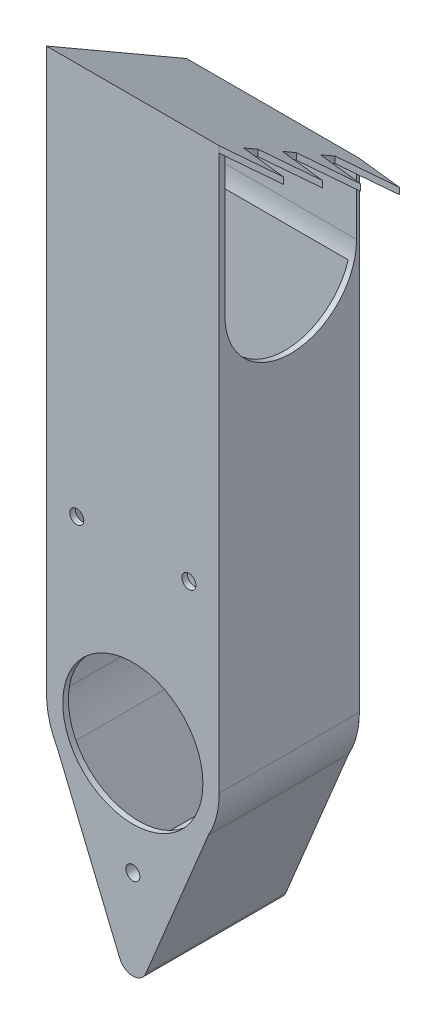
ISO-10303-21;
HEADER;
FILE_DESCRIPTION(('STEP AP214'),'2;1');
FILE_NAME('part.step','',(''),(''),'','','');
FILE_SCHEMA(('AUTOMOTIVE_DESIGN { 1 0 10303 214 1 1 1 1 }'));
ENDSEC;
DATA;
#1=APPLICATION_CONTEXT('core data for automotive mechanical design processes');
#2=APPLICATION_PROTOCOL_DEFINITION('international standard','automotive_design',2000,#1);
#3=PRODUCT_CONTEXT('',#1,'mechanical');
#4=PRODUCT('Part','Part','',(#3));
#5=PRODUCT_RELATED_PRODUCT_CATEGORY('part','',(#4));
#6=PRODUCT_DEFINITION_FORMATION('','',#4);
#7=PRODUCT_DEFINITION_CONTEXT('part definition',#1,'design');
#8=PRODUCT_DEFINITION('design','',#6,#7);
#9=PRODUCT_DEFINITION_SHAPE('','',#8);
#10=(LENGTH_UNIT() NAMED_UNIT(*) SI_UNIT(.MILLI.,.METRE.));
#11=(NAMED_UNIT(*) PLANE_ANGLE_UNIT() SI_UNIT($,.RADIAN.));
#12=(NAMED_UNIT(*) SI_UNIT($,.STERADIAN.) SOLID_ANGLE_UNIT());
#13=UNCERTAINTY_MEASURE_WITH_UNIT(LENGTH_MEASURE(1.E-05),#10,'distance_accuracy_value','');
#14=(GEOMETRIC_REPRESENTATION_CONTEXT(3) GLOBAL_UNCERTAINTY_ASSIGNED_CONTEXT((#13)) GLOBAL_UNIT_ASSIGNED_CONTEXT((#10,
#11,#12)) REPRESENTATION_CONTEXT('',''));
#15=CARTESIAN_POINT('',(0.,0.,0.));
#16=DIRECTION('',(0.,0.,1.));
#17=DIRECTION('',(1.,0.,0.));
#18=AXIS2_PLACEMENT_3D('',#15,#16,#17);
#19=CARTESIAN_POINT('',(41.1040145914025,334.660691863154,63.5));
#20=DIRECTION('',(-1.,0.,0.));
#21=DIRECTION('',(0.,0.,1.));
#22=AXIS2_PLACEMENT_3D('',#19,#20,#21);
#23=PLANE('',#22);
#24=DIRECTION('',(0.,-0.499999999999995,-0.866025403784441));
#25=VECTOR('',#24,1.);
#26=CARTESIAN_POINT('',(41.1040145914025,324.486077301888,50.9570506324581));
#27=LINE('',#26,#25);
#28=CARTESIAN_POINT('',(41.1040145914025,331.72775249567,63.5));
#29=VERTEX_POINT('',#28);
#30=CARTESIAN_POINT('',(41.1040145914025,330.261282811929,60.96));
#31=VERTEX_POINT('',#30);
#32=EDGE_CURVE('E368',#29,#31,#27,.T.);
#33=ORIENTED_EDGE('',*,*,#32,.F.);
#34=DIRECTION('',(0.,1.,0.));
#35=VECTOR('',#34,1.);
#36=CARTESIAN_POINT('',(41.1040145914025,334.660691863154,63.5));
#37=LINE('',#36,#35);
#38=CARTESIAN_POINT('',(41.1040145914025,80.6606918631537,63.5));
#39=VERTEX_POINT('',#38);
#40=EDGE_CURVE('E273',#39,#29,#37,.T.);
#41=ORIENTED_EDGE('',*,*,#40,.F.);
#42=DIRECTION('',(0.,0.,-1.));
#43=VECTOR('',#42,1.);
#44=CARTESIAN_POINT('',(41.1040145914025,80.6606918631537,63.5));
#45=LINE('',#44,#43);
#46=CARTESIAN_POINT('',(41.1040145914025,80.6606918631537,0.));
#47=VERTEX_POINT('',#46);
#48=EDGE_CURVE('E322',#39,#47,#45,.T.);
#49=ORIENTED_EDGE('',*,*,#48,.T.);
#50=DIRECTION('',(0.,1.,0.));
#51=VECTOR('',#50,1.);
#52=CARTESIAN_POINT('',(41.1040145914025,334.660691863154,0.));
#53=LINE('',#52,#51);
#54=CARTESIAN_POINT('',(41.1040145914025,295.06601040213,0.));
#55=VERTEX_POINT('',#54);
#56=EDGE_CURVE('E304',#47,#55,#53,.T.);
#57=ORIENTED_EDGE('',*,*,#56,.T.);
#58=DIRECTION('',(0.,-0.499999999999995,-0.866025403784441));
#59=VECTOR('',#58,1.);
#60=CARTESIAN_POINT('',(41.1040145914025,294.174335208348,-1.54442673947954));
#61=LINE('',#60,#59);
#62=CARTESIAN_POINT('',(41.1040145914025,295.799245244,1.26999999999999));
#63=VERTEX_POINT('',#62);
#64=EDGE_CURVE('E438',#63,#55,#61,.T.);
#65=ORIENTED_EDGE('',*,*,#64,.F.);
#66=DIRECTION('',(0.,1.,0.));
#67=VECTOR('',#66,1.);
#68=CARTESIAN_POINT('',(41.1040145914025,295.799245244,1.26999999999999));
#69=LINE('',#68,#67);
#70=CARTESIAN_POINT('',(41.1040145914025,266.761282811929,1.26999999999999));
#71=VERTEX_POINT('',#70);
#72=EDGE_CURVE('E596',#71,#63,#69,.T.);
#73=ORIENTED_EDGE('',*,*,#72,.F.);
#74=CARTESIAN_POINT('',(41.1040145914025,266.761282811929,31.115));
#75=DIRECTION('',(1.,0.,0.));
#76=DIRECTION('',(0.,0.,-1.));
#77=AXIS2_PLACEMENT_3D('',#74,#75,#76);
#78=CIRCLE('',#77,29.845);
#79=CARTESIAN_POINT('',(41.1040145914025,266.761282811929,60.96));
#80=VERTEX_POINT('',#79);
#81=EDGE_CURVE('E575',#80,#71,#78,.T.);
#82=ORIENTED_EDGE('',*,*,#81,.F.);
#83=DIRECTION('',(0.,-1.,0.));
#84=VECTOR('',#83,1.);
#85=CARTESIAN_POINT('',(41.1040145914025,266.761282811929,60.96));
#86=LINE('',#85,#84);
#87=EDGE_CURVE('E371',#31,#80,#86,.T.);
#88=ORIENTED_EDGE('',*,*,#87,.F.);
#89=EDGE_LOOP('',(#33,#41,#49,#57,#65,#73,#82,#88));
#90=FACE_BOUND('',#89,.T.);
#91=ADVANCED_FACE('F39',(#90),#23,.F.);
#92=DIRECTION('',(0.,-0.499999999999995,-0.866025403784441));
#93=VECTOR('',#92,1.);
#94=CARTESIAN_POINT('',(41.1040145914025,297.998949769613,0.));
#95=LINE('',#94,#93);
#96=CARTESIAN_POINT('',(41.1040145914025,318.150691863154,34.9038411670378));
#97=VERTEX_POINT('',#96);
#98=CARTESIAN_POINT('',(41.1040145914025,314.508949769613,28.5961588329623));
#99=VERTEX_POINT('',#98);
#100=EDGE_CURVE('E625',#97,#99,#95,.T.);
#101=ORIENTED_EDGE('',*,*,#100,.F.);
#102=DIRECTION('',(0.,1.,0.));
#103=VECTOR('',#102,1.);
#104=CARTESIAN_POINT('',(41.1040145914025,286.251051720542,34.9038411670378));
#105=LINE('',#104,#103);
#106=CARTESIAN_POINT('',(41.1040145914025,315.217752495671,34.9038411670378));
#107=VERTEX_POINT('',#106);
#108=EDGE_CURVE('E395',#107,#97,#105,.T.);
#109=ORIENTED_EDGE('',*,*,#108,.F.);
#110=DIRECTION('',(0.,0.499999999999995,0.866025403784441));
#111=VECTOR('',#110,1.);
#112=CARTESIAN_POINT('',(41.1040145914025,330.261282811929,60.96));
#113=LINE('',#112,#111);
#114=CARTESIAN_POINT('',(41.1040145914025,311.576010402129,28.5961588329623));
#115=VERTEX_POINT('',#114);
#116=EDGE_CURVE('E605',#115,#107,#113,.T.);
#117=ORIENTED_EDGE('',*,*,#116,.F.);
#118=DIRECTION('',(0.,1.,0.));
#119=VECTOR('',#118,1.);
#120=CARTESIAN_POINT('',(41.1040145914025,282.609309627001,28.5961588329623));
#121=LINE('',#120,#119);
#122=EDGE_CURVE('E63',#115,#99,#121,.T.);
#123=ORIENTED_EDGE('',*,*,#122,.T.);
#124=EDGE_LOOP('',(#101,#109,#117,#123));
#125=FACE_BOUND('',#124,.T.);
#126=ADVANCED_FACE('F752',(#125),#23,.F.);
#127=CARTESIAN_POINT('',(41.1040145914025,308.158949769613,17.5976362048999));
#128=VERTEX_POINT('',#127);
#129=CARTESIAN_POINT('',(41.1040145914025,304.348949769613,10.9985226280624));
#130=VERTEX_POINT('',#129);
#131=EDGE_CURVE('E626',#128,#130,#95,.T.);
#132=ORIENTED_EDGE('',*,*,#131,.F.);
#133=DIRECTION('',(0.,1.,0.));
#134=VECTOR('',#133,1.);
#135=CARTESIAN_POINT('',(41.1040145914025,276.259309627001,17.5976362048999));
#136=LINE('',#135,#134);
#137=CARTESIAN_POINT('',(41.1040145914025,305.22601040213,17.5976362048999));
#138=VERTEX_POINT('',#137);
#139=EDGE_CURVE('E417',#138,#128,#136,.T.);
#140=ORIENTED_EDGE('',*,*,#139,.F.);
#141=CARTESIAN_POINT('',(41.1040145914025,301.41601040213,10.9985226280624));
#142=VERTEX_POINT('',#141);
#143=EDGE_CURVE('E601',#142,#138,#113,.T.);
#144=ORIENTED_EDGE('',*,*,#143,.F.);
#145=DIRECTION('',(0.,1.,0.));
#146=VECTOR('',#145,1.);
#147=CARTESIAN_POINT('',(41.1040145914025,272.449309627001,10.9985226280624));
#148=LINE('',#147,#146);
#149=EDGE_CURVE('E450',#142,#130,#148,.T.);
#150=ORIENTED_EDGE('',*,*,#149,.T.);
#151=EDGE_LOOP('',(#132,#140,#144,#150));
#152=FACE_BOUND('',#151,.T.);
#153=ADVANCED_FACE('F758',(#152),#23,.F.);
#154=CARTESIAN_POINT('',(27.3621407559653,156.860691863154,63.5));
#155=DIRECTION('',(0.,0.,-1.));
#156=DIRECTION('',(-1.,0.,0.));
#157=AXIS2_PLACEMENT_3D('',#154,#155,#156);
#158=CYLINDRICAL_SURFACE('',#157,3.175);
#159=CARTESIAN_POINT('',(27.3621407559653,156.860691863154,0.));
#160=DIRECTION('',(0.,0.,1.));
#161=DIRECTION('',(1.,0.,0.));
#162=AXIS2_PLACEMENT_3D('',#159,#160,#161);
#163=CIRCLE('',#162,3.175);
#164=CARTESIAN_POINT('',(30.5371407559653,156.860691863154,0.));
#165=VERTEX_POINT('',#164);
#166=EDGE_CURVE('E644',#165,#165,#163,.T.);
#167=ORIENTED_EDGE('',*,*,#166,.F.);
#168=EDGE_LOOP('',(#167));
#169=FACE_BOUND('',#168,.T.);
#170=CARTESIAN_POINT('',(27.3621407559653,156.860691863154,2.54));
#171=DIRECTION('',(0.,0.,1.));
#172=DIRECTION('',(1.,0.,0.));
#173=AXIS2_PLACEMENT_3D('',#170,#171,#172);
#174=CIRCLE('',#173,3.175);
#175=CARTESIAN_POINT('',(30.5371407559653,156.860691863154,2.54));
#176=VERTEX_POINT('',#175);
#177=EDGE_CURVE('E551',#176,#176,#174,.T.);
#178=ORIENTED_EDGE('',*,*,#177,.T.);
#179=EDGE_LOOP('',(#178));
#180=FACE_BOUND('',#179,.T.);
#181=ADVANCED_FACE('F770',(#169,#180),#158,.F.);
#182=CARTESIAN_POINT('',(-23.4378592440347,156.860691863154,63.5));
#183=DIRECTION('',(0.,0.,-1.));
#184=DIRECTION('',(-1.,0.,0.));
#185=AXIS2_PLACEMENT_3D('',#182,#183,#184);
#186=CYLINDRICAL_SURFACE('',#185,3.175);
#187=CARTESIAN_POINT('',(-23.4378592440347,156.860691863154,0.));
#188=DIRECTION('',(0.,0.,1.));
#189=DIRECTION('',(1.,0.,0.));
#190=AXIS2_PLACEMENT_3D('',#187,#188,#189);
#191=CIRCLE('',#190,3.175);
#192=CARTESIAN_POINT('',(-20.2628592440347,156.860691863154,0.));
#193=VERTEX_POINT('',#192);
#194=EDGE_CURVE('E636',#193,#193,#191,.T.);
#195=ORIENTED_EDGE('',*,*,#194,.F.);
#196=EDGE_LOOP('',(#195));
#197=FACE_BOUND('',#196,.T.);
#198=CARTESIAN_POINT('',(-23.4378592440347,156.860691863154,2.54));
#199=DIRECTION('',(0.,0.,1.));
#200=DIRECTION('',(1.,0.,0.));
#201=AXIS2_PLACEMENT_3D('',#198,#199,#200);
#202=CIRCLE('',#201,3.175);
#203=CARTESIAN_POINT('',(-20.2628592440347,156.860691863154,2.54));
#204=VERTEX_POINT('',#203);
#205=EDGE_CURVE('E499',#204,#204,#202,.T.);
#206=ORIENTED_EDGE('',*,*,#205,.T.);
#207=EDGE_LOOP('',(#206));
#208=FACE_BOUND('',#207,.T.);
#209=ADVANCED_FACE('F775',(#197,#208),#186,.F.);
#210=CARTESIAN_POINT('',(-32.5559854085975,266.761282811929,31.115));
#211=DIRECTION('',(1.,0.,0.));
#212=DIRECTION('',(0.,0.,-1.));
#213=AXIS2_PLACEMENT_3D('',#210,#211,#212);
#214=CYLINDRICAL_SURFACE('',#213,29.845);
#215=DIRECTION('',(1.,0.,0.));
#216=VECTOR('',#215,1.);
#217=CARTESIAN_POINT('',(-32.5559854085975,258.14772373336,2.54));
#218=LINE('',#217,#216);
#219=CARTESIAN_POINT('',(38.5640145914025,258.14772373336,2.54));
#220=VERTEX_POINT('',#219);
#221=CARTESIAN_POINT('',(-32.5559854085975,258.14772373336,2.54));
#222=VERTEX_POINT('',#221);
#223=EDGE_CURVE('E567',#220,#222,#218,.F.);
#224=ORIENTED_EDGE('',*,*,#223,.F.);
#225=CARTESIAN_POINT('',(38.5640145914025,266.761282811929,31.115));
#226=DIRECTION('',(-1.,0.,0.));
#227=DIRECTION('',(0.,0.,1.));
#228=AXIS2_PLACEMENT_3D('',#225,#226,#227);
#229=CIRCLE('',#228,29.845);
#230=CARTESIAN_POINT('',(38.5640145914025,266.761282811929,60.96));
#231=VERTEX_POINT('',#230);
#232=EDGE_CURVE('E462',#231,#220,#229,.F.);
#233=ORIENTED_EDGE('',*,*,#232,.F.);
#234=DIRECTION('',(1.,0.,0.));
#235=VECTOR('',#234,1.);
#236=CARTESIAN_POINT('',(-32.5559854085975,266.761282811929,60.96));
#237=LINE('',#236,#235);
#238=EDGE_CURVE('E608',#231,#80,#237,.T.);
#239=ORIENTED_EDGE('',*,*,#238,.T.);
#240=ORIENTED_EDGE('',*,*,#81,.T.);
#241=DIRECTION('',(1.,0.,0.));
#242=VECTOR('',#241,1.);
#243=CARTESIAN_POINT('',(-32.5559854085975,266.761282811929,1.26999999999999));
#244=LINE('',#243,#242);
#245=CARTESIAN_POINT('',(-32.5559854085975,266.761282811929,1.26999999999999));
#246=VERTEX_POINT('',#245);
#247=EDGE_CURVE('E593',#246,#71,#244,.T.);
#248=ORIENTED_EDGE('',*,*,#247,.F.);
#249=CARTESIAN_POINT('',(-32.5559854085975,266.761282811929,31.115));
#250=DIRECTION('',(1.,0.,0.));
#251=DIRECTION('',(0.,0.,-1.));
#252=AXIS2_PLACEMENT_3D('',#249,#250,#251);
#253=CIRCLE('',#252,29.845);
#254=EDGE_CURVE('E581',#222,#246,#253,.T.);
#255=ORIENTED_EDGE('',*,*,#254,.F.);
#256=EDGE_LOOP('',(#224,#233,#239,#240,#248,#255));
#257=FACE_BOUND('',#256,.T.);
#258=ADVANCED_FACE('F711',(#257),#214,.F.);
#259=CARTESIAN_POINT('',(1.96214075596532,80.6606918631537,63.5));
#260=DIRECTION('',(0.,0.,1.));
#261=DIRECTION('',(1.,0.,0.));
#262=AXIS2_PLACEMENT_3D('',#259,#260,#261);
#263=PLANE('',#262);
#264=CARTESIAN_POINT('',(-23.4378592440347,156.860691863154,63.5));
#265=DIRECTION('',(0.,0.,1.));
#266=DIRECTION('',(1.,0.,0.));
#267=AXIS2_PLACEMENT_3D('',#264,#265,#266);
#268=CIRCLE('',#267,3.175);
#269=CARTESIAN_POINT('',(-20.2628592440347,156.860691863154,63.5));
#270=VERTEX_POINT('',#269);
#271=EDGE_CURVE('E640',#270,#270,#268,.T.);
#272=ORIENTED_EDGE('',*,*,#271,.F.);
#273=EDGE_LOOP('',(#272));
#274=FACE_BOUND('',#273,.T.);
#275=CARTESIAN_POINT('',(1.96214075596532,80.6606918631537,63.5));
#276=DIRECTION('',(0.,0.,1.));
#277=DIRECTION('',(1.,0.,0.));
#278=AXIS2_PLACEMENT_3D('',#275,#276,#277);
#279=CIRCLE('',#278,31.75);
#280=CARTESIAN_POINT('',(33.7121407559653,80.6606918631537,63.5));
#281=VERTEX_POINT('',#280);
#282=EDGE_CURVE('E298',#281,#281,#279,.T.);
#283=ORIENTED_EDGE('',*,*,#282,.F.);
#284=EDGE_LOOP('',(#283));
#285=FACE_BOUND('',#284,.T.);
#286=DIRECTION('',(0.382683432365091,-0.923879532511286,0.));
#287=VECTOR('',#286,1.);
#288=CARTESIAN_POINT('',(1.96214075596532,-20.9393081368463,63.5));
#289=LINE('',#288,#287);
#290=CARTESIAN_POINT('',(-32.2311888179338,61.6106918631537,63.5));
#291=VERTEX_POINT('',#290);
#292=CARTESIAN_POINT('',(-3.90449427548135,-6.77599827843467,63.5));
#293=VERTEX_POINT('',#292);
#294=EDGE_CURVE('E314',#291,#293,#289,.T.);
#295=ORIENTED_EDGE('',*,*,#294,.T.);
#296=CARTESIAN_POINT('',(1.96214075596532,-4.34595848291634,63.5));
#297=DIRECTION('',(0.,0.,1.));
#298=DIRECTION('',(1.,0.,0.));
#299=AXIS2_PLACEMENT_3D('',#296,#297,#298);
#300=CIRCLE('',#299,6.35);
#301=CARTESIAN_POINT('',(7.82877578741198,-6.77599827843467,63.5));
#302=VERTEX_POINT('',#301);
#303=EDGE_CURVE('E11',#293,#302,#300,.T.);
#304=ORIENTED_EDGE('',*,*,#303,.T.);
#305=DIRECTION('',(0.382683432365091,0.923879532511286,0.));
#306=VECTOR('',#305,1.);
#307=CARTESIAN_POINT('',(1.96214075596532,-20.9393081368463,63.5));
#308=LINE('',#307,#306);
#309=CARTESIAN_POINT('',(36.1554703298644,61.6106918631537,63.5));
#310=VERTEX_POINT('',#309);
#311=EDGE_CURVE('E348',#302,#310,#308,.T.);
#312=ORIENTED_EDGE('',*,*,#311,.T.);
#313=CARTESIAN_POINT('',(1.96214075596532,80.6606918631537,63.5));
#314=DIRECTION('',(0.,0.,1.));
#315=DIRECTION('',(1.,0.,0.));
#316=AXIS2_PLACEMENT_3D('',#313,#314,#315);
#317=CIRCLE('',#316,39.1418738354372);
#318=EDGE_CURVE('E286',#310,#39,#317,.T.);
#319=ORIENTED_EDGE('',*,*,#318,.T.);
#320=ORIENTED_EDGE('',*,*,#40,.T.);
#321=DIRECTION('',(0.,1.,0.));
#322=VECTOR('',#321,1.);
#323=CARTESIAN_POINT('',(41.1040145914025,302.761051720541,63.5));
#324=LINE('',#323,#322);
#325=CARTESIAN_POINT('',(41.1040145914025,334.660691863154,63.5));
#326=VERTEX_POINT('',#325);
#327=EDGE_CURVE('E253',#29,#326,#324,.T.);
#328=ORIENTED_EDGE('',*,*,#327,.T.);
#329=DIRECTION('',(-1.,0.,0.));
#330=VECTOR('',#329,1.);
#331=CARTESIAN_POINT('',(-37.1797330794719,334.660691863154,63.5));
#332=LINE('',#331,#330);
#333=CARTESIAN_POINT('',(-37.1797330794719,334.660691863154,63.5));
#334=VERTEX_POINT('',#333);
#335=EDGE_CURVE('E270',#326,#334,#332,.T.);
#336=ORIENTED_EDGE('',*,*,#335,.T.);
#337=DIRECTION('',(0.,-1.,0.));
#338=VECTOR('',#337,1.);
#339=CARTESIAN_POINT('',(-37.1797330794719,80.6606918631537,63.5));
#340=LINE('',#339,#338);
#341=CARTESIAN_POINT('',(-37.1797330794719,80.6606918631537,63.5));
#342=VERTEX_POINT('',#341);
#343=EDGE_CURVE('E280',#334,#342,#340,.T.);
#344=ORIENTED_EDGE('',*,*,#343,.T.);
#345=CARTESIAN_POINT('',(1.96214075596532,80.6606918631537,63.5));
#346=DIRECTION('',(0.,0.,1.));
#347=DIRECTION('',(1.,0.,0.));
#348=AXIS2_PLACEMENT_3D('',#345,#346,#347);
#349=CIRCLE('',#348,39.1418738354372);
#350=EDGE_CURVE('E284',#342,#291,#349,.T.);
#351=ORIENTED_EDGE('',*,*,#350,.T.);
#352=EDGE_LOOP('',(#295,#304,#312,#319,#320,#328,#336,#344,#351));
#353=FACE_BOUND('',#352,.T.);
#354=CARTESIAN_POINT('',(27.3621407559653,156.860691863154,63.5));
#355=DIRECTION('',(0.,0.,1.));
#356=DIRECTION('',(1.,0.,0.));
#357=AXIS2_PLACEMENT_3D('',#354,#355,#356);
#358=CIRCLE('',#357,3.175);
#359=CARTESIAN_POINT('',(30.5371407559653,156.860691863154,63.5));
#360=VERTEX_POINT('',#359);
#361=EDGE_CURVE('E648',#360,#360,#358,.T.);
#362=ORIENTED_EDGE('',*,*,#361,.F.);
#363=EDGE_LOOP('',(#362));
#364=FACE_BOUND('',#363,.T.);
#365=CARTESIAN_POINT('',(1.96214075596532,29.8606918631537,63.5));
#366=DIRECTION('',(0.,0.,1.));
#367=DIRECTION('',(1.,0.,0.));
#368=AXIS2_PLACEMENT_3D('',#365,#366,#367);
#369=CIRCLE('',#368,3.175);
#370=CARTESIAN_POINT('',(5.13714075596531,29.8606918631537,63.5));
#371=VERTEX_POINT('',#370);
#372=EDGE_CURVE('E632',#371,#371,#369,.T.);
#373=ORIENTED_EDGE('',*,*,#372,.F.);
#374=EDGE_LOOP('',(#373));
#375=FACE_BOUND('',#374,.T.);
#376=ADVANCED_FACE('F268',(#274,#285,#353,#364,#375),#263,.T.);
#377=CARTESIAN_POINT('',(1.96214075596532,80.6606918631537,0.));
#378=DIRECTION('',(0.,0.,1.));
#379=DIRECTION('',(1.,0.,0.));
#380=AXIS2_PLACEMENT_3D('',#377,#378,#379);
#381=PLANE('',#380);
#382=DIRECTION('',(0.,-1.,0.));
#383=VECTOR('',#382,1.);
#384=CARTESIAN_POINT('',(-37.1797330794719,80.6606918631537,0.));
#385=LINE('',#384,#383);
#386=CARTESIAN_POINT('',(-37.1797330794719,297.998949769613,0.));
#387=VERTEX_POINT('',#386);
#388=CARTESIAN_POINT('',(-37.1797330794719,80.6606918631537,0.));
#389=VERTEX_POINT('',#388);
#390=EDGE_CURVE('E308',#387,#389,#385,.T.);
#391=ORIENTED_EDGE('',*,*,#390,.F.);
#392=DIRECTION('',(-1.,0.,0.));
#393=VECTOR('',#392,1.);
#394=CARTESIAN_POINT('',(114.427498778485,297.998949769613,0.));
#395=LINE('',#394,#393);
#396=CARTESIAN_POINT('',(41.1040145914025,297.998949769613,0.));
#397=VERTEX_POINT('',#396);
#398=EDGE_CURVE('E629',#397,#387,#395,.T.);
#399=ORIENTED_EDGE('',*,*,#398,.F.);
#400=DIRECTION('',(0.,1.,0.));
#401=VECTOR('',#400,1.);
#402=CARTESIAN_POINT('',(41.1040145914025,266.099309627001,0.));
#403=LINE('',#402,#401);
#404=EDGE_CURVE('E439',#55,#397,#403,.T.);
#405=ORIENTED_EDGE('',*,*,#404,.F.);
#406=ORIENTED_EDGE('',*,*,#56,.F.);
#407=CARTESIAN_POINT('',(1.96214075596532,80.6606918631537,0.));
#408=DIRECTION('',(0.,0.,1.));
#409=DIRECTION('',(1.,0.,0.));
#410=AXIS2_PLACEMENT_3D('',#407,#408,#409);
#411=CIRCLE('',#410,39.1418738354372);
#412=CARTESIAN_POINT('',(36.1554703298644,61.6106918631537,0.));
#413=VERTEX_POINT('',#412);
#414=EDGE_CURVE('E301',#413,#47,#411,.T.);
#415=ORIENTED_EDGE('',*,*,#414,.F.);
#416=DIRECTION('',(0.382683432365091,0.923879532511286,0.));
#417=VECTOR('',#416,1.);
#418=CARTESIAN_POINT('',(1.96214075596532,-20.9393081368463,0.));
#419=LINE('',#418,#417);
#420=CARTESIAN_POINT('',(7.82877578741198,-6.77599827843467,0.));
#421=VERTEX_POINT('',#420);
#422=EDGE_CURVE('E297',#421,#413,#419,.T.);
#423=ORIENTED_EDGE('',*,*,#422,.F.);
#424=CARTESIAN_POINT('',(1.96214075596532,-4.34595848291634,0.));
#425=DIRECTION('',(0.,0.,1.));
#426=DIRECTION('',(1.,0.,0.));
#427=AXIS2_PLACEMENT_3D('',#424,#425,#426);
#428=CIRCLE('',#427,6.35);
#429=CARTESIAN_POINT('',(-3.90449427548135,-6.77599827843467,0.));
#430=VERTEX_POINT('',#429);
#431=EDGE_CURVE('E334',#421,#430,#428,.F.);
#432=ORIENTED_EDGE('',*,*,#431,.T.);
#433=DIRECTION('',(0.382683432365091,-0.923879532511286,0.));
#434=VECTOR('',#433,1.);
#435=CARTESIAN_POINT('',(1.96214075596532,-20.9393081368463,0.));
#436=LINE('',#435,#434);
#437=CARTESIAN_POINT('',(-32.2311888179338,61.6106918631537,0.));
#438=VERTEX_POINT('',#437);
#439=EDGE_CURVE('E293',#438,#430,#436,.T.);
#440=ORIENTED_EDGE('',*,*,#439,.F.);
#441=CARTESIAN_POINT('',(1.96214075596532,80.6606918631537,0.));
#442=DIRECTION('',(0.,0.,1.));
#443=DIRECTION('',(1.,0.,0.));
#444=AXIS2_PLACEMENT_3D('',#441,#442,#443);
#445=CIRCLE('',#444,39.1418738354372);
#446=EDGE_CURVE('E311',#389,#438,#445,.T.);
#447=ORIENTED_EDGE('',*,*,#446,.F.);
#448=EDGE_LOOP('',(#391,#399,#405,#406,#415,#423,#432,#440,#447));
#449=FACE_BOUND('',#448,.T.);
#450=ORIENTED_EDGE('',*,*,#166,.T.);
#451=EDGE_LOOP('',(#450));
#452=FACE_BOUND('',#451,.T.);
#453=ORIENTED_EDGE('',*,*,#194,.T.);
#454=EDGE_LOOP('',(#453));
#455=FACE_BOUND('',#454,.T.);
#456=CARTESIAN_POINT('',(1.96214075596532,29.8606918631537,0.));
#457=DIRECTION('',(0.,0.,1.));
#458=DIRECTION('',(1.,0.,0.));
#459=AXIS2_PLACEMENT_3D('',#456,#457,#458);
#460=CIRCLE('',#459,3.175);
#461=CARTESIAN_POINT('',(5.13714075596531,29.8606918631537,0.));
#462=VERTEX_POINT('',#461);
#463=EDGE_CURVE('E624',#462,#462,#460,.T.);
#464=ORIENTED_EDGE('',*,*,#463,.T.);
#465=EDGE_LOOP('',(#464));
#466=FACE_BOUND('',#465,.T.);
#467=ADVANCED_FACE('F358',(#449,#452,#455,#466),#381,.F.);
#468=CARTESIAN_POINT('',(1.96214075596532,-20.9393081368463,63.5));
#469=DIRECTION('',(0.923879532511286,0.382683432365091,0.));
#470=DIRECTION('',(-0.382683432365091,0.923879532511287,0.));
#471=AXIS2_PLACEMENT_3D('',#468,#469,#470);
#472=PLANE('',#471);
#473=ORIENTED_EDGE('',*,*,#439,.T.);
#474=DIRECTION('',(0.,0.,-1.));
#475=VECTOR('',#474,1.);
#476=CARTESIAN_POINT('',(-3.90449427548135,-6.77599827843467,63.5));
#477=LINE('',#476,#475);
#478=EDGE_CURVE('E48',#430,#293,#477,.F.);
#479=ORIENTED_EDGE('',*,*,#478,.T.);
#480=ORIENTED_EDGE('',*,*,#294,.F.);
#481=DIRECTION('',(0.,0.,-1.));
#482=VECTOR('',#481,1.);
#483=CARTESIAN_POINT('',(-32.2311888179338,61.6106918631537,63.5));
#484=LINE('',#483,#482);
#485=EDGE_CURVE('E292',#291,#438,#484,.T.);
#486=ORIENTED_EDGE('',*,*,#485,.T.);
#487=EDGE_LOOP('',(#473,#479,#480,#486));
#488=FACE_BOUND('',#487,.T.);
#489=ADVANCED_FACE('F340',(#488),#472,.F.);
#490=CARTESIAN_POINT('',(1.96214075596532,-20.9393081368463,63.5));
#491=DIRECTION('',(-0.923879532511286,0.382683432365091,0.));
#492=DIRECTION('',(-0.382683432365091,-0.923879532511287,0.));
#493=AXIS2_PLACEMENT_3D('',#490,#491,#492);
#494=PLANE('',#493);
#495=ORIENTED_EDGE('',*,*,#311,.F.);
#496=DIRECTION('',(0.,0.,-1.));
#497=VECTOR('',#496,1.);
#498=CARTESIAN_POINT('',(7.82877578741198,-6.77599827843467,63.5));
#499=LINE('',#498,#497);
#500=EDGE_CURVE('E330',#302,#421,#499,.T.);
#501=ORIENTED_EDGE('',*,*,#500,.T.);
#502=ORIENTED_EDGE('',*,*,#422,.T.);
#503=DIRECTION('',(0.,0.,-1.));
#504=VECTOR('',#503,1.);
#505=CARTESIAN_POINT('',(36.1554703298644,61.6106918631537,63.5));
#506=LINE('',#505,#504);
#507=EDGE_CURVE('E326',#310,#413,#506,.T.);
#508=ORIENTED_EDGE('',*,*,#507,.F.);
#509=EDGE_LOOP('',(#495,#501,#502,#508));
#510=FACE_BOUND('',#509,.T.);
#511=ADVANCED_FACE('F353',(#510),#494,.F.);
#512=CARTESIAN_POINT('',(1.96214075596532,80.6606918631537,63.5));
#513=DIRECTION('',(0.,0.,-1.));
#514=DIRECTION('',(-1.,0.,0.));
#515=AXIS2_PLACEMENT_3D('',#512,#513,#514);
#516=CYLINDRICAL_SURFACE('',#515,39.1418738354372);
#517=ORIENTED_EDGE('',*,*,#414,.T.);
#518=ORIENTED_EDGE('',*,*,#48,.F.);
#519=ORIENTED_EDGE('',*,*,#318,.F.);
#520=ORIENTED_EDGE('',*,*,#507,.T.);
#521=EDGE_LOOP('',(#517,#518,#519,#520));
#522=FACE_BOUND('',#521,.T.);
#523=ADVANCED_FACE('F364',(#522),#516,.T.);
#524=CARTESIAN_POINT('',(41.1040145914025,328.310691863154,52.5014773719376));
#525=VERTEX_POINT('',#524);
#526=CARTESIAN_POINT('',(41.1040145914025,324.500691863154,45.9023637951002));
#527=VERTEX_POINT('',#526);
#528=EDGE_CURVE('E621',#525,#527,#95,.T.);
#529=ORIENTED_EDGE('',*,*,#528,.F.);
#530=DIRECTION('',(0.,1.,0.));
#531=VECTOR('',#530,1.);
#532=CARTESIAN_POINT('',(41.1040145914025,296.411051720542,52.5014773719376));
#533=LINE('',#532,#531);
#534=CARTESIAN_POINT('',(41.1040145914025,325.377752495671,52.5014773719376));
#535=VERTEX_POINT('',#534);
#536=EDGE_CURVE('E382',#535,#525,#533,.T.);
#537=ORIENTED_EDGE('',*,*,#536,.F.);
#538=CARTESIAN_POINT('',(41.1040145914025,321.567752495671,45.9023637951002));
#539=VERTEX_POINT('',#538);
#540=EDGE_CURVE('E600',#539,#535,#113,.T.);
#541=ORIENTED_EDGE('',*,*,#540,.F.);
#542=DIRECTION('',(0.,1.,0.));
#543=VECTOR('',#542,1.);
#544=CARTESIAN_POINT('',(41.1040145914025,292.601051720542,45.9023637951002));
#545=LINE('',#544,#543);
#546=EDGE_CURVE('E55',#539,#527,#545,.T.);
#547=ORIENTED_EDGE('',*,*,#546,.T.);
#548=EDGE_LOOP('',(#529,#537,#541,#547));
#549=FACE_BOUND('',#548,.T.);
#550=ADVANCED_FACE('F748',(#549),#23,.F.);
#551=CARTESIAN_POINT('',(-37.1797330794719,80.6606918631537,63.5));
#552=DIRECTION('',(1.,0.,0.));
#553=DIRECTION('',(0.,0.,-1.));
#554=AXIS2_PLACEMENT_3D('',#551,#552,#553);
#555=PLANE('',#554);
#556=ORIENTED_EDGE('',*,*,#343,.F.);
#557=DIRECTION('',(0.,0.499999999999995,0.866025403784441));
#558=VECTOR('',#557,1.);
#559=CARTESIAN_POINT('',(-37.1797330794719,297.998949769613,0.));
#560=LINE('',#559,#558);
#561=EDGE_CURVE('E278',#387,#334,#560,.T.);
#562=ORIENTED_EDGE('',*,*,#561,.F.);
#563=ORIENTED_EDGE('',*,*,#390,.T.);
#564=DIRECTION('',(0.,0.,-1.));
#565=VECTOR('',#564,1.);
#566=CARTESIAN_POINT('',(-37.1797330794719,80.6606918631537,63.5));
#567=LINE('',#566,#565);
#568=EDGE_CURVE('E318',#342,#389,#567,.T.);
#569=ORIENTED_EDGE('',*,*,#568,.F.);
#570=EDGE_LOOP('',(#556,#562,#563,#569));
#571=FACE_BOUND('',#570,.T.);
#572=ADVANCED_FACE('F734',(#571),#555,.F.);
#573=CARTESIAN_POINT('',(1.96214075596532,80.6606918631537,63.5));
#574=DIRECTION('',(0.,0.,-1.));
#575=DIRECTION('',(-1.,0.,0.));
#576=AXIS2_PLACEMENT_3D('',#573,#574,#575);
#577=CYLINDRICAL_SURFACE('',#576,39.1418738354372);
#578=ORIENTED_EDGE('',*,*,#446,.T.);
#579=ORIENTED_EDGE('',*,*,#485,.F.);
#580=ORIENTED_EDGE('',*,*,#350,.F.);
#581=ORIENTED_EDGE('',*,*,#568,.T.);
#582=EDGE_LOOP('',(#578,#579,#580,#581));
#583=FACE_BOUND('',#582,.T.);
#584=ADVANCED_FACE('F737',(#583),#577,.T.);
#585=CARTESIAN_POINT('',(1.96214075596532,80.6606918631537,63.5));
#586=DIRECTION('',(0.,0.,-1.));
#587=DIRECTION('',(-1.,0.,0.));
#588=AXIS2_PLACEMENT_3D('',#585,#586,#587);
#589=CYLINDRICAL_SURFACE('',#588,31.75);
#590=CARTESIAN_POINT('',(1.96214075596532,80.6606918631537,60.96));
#591=DIRECTION('',(0.,0.,1.));
#592=DIRECTION('',(1.,0.,0.));
#593=AXIS2_PLACEMENT_3D('',#590,#591,#592);
#594=CIRCLE('',#593,31.75);
#595=CARTESIAN_POINT('',(33.7121407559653,80.6606918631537,60.96));
#596=VERTEX_POINT('',#595);
#597=EDGE_CURVE('E505',#596,#596,#594,.T.);
#598=ORIENTED_EDGE('',*,*,#597,.F.);
#599=EDGE_LOOP('',(#598));
#600=FACE_BOUND('',#599,.T.);
#601=ORIENTED_EDGE('',*,*,#282,.T.);
#602=EDGE_LOOP('',(#601));
#603=FACE_BOUND('',#602,.T.);
#604=ADVANCED_FACE('F739',(#600,#603),#589,.F.);
#605=CARTESIAN_POINT('',(27.3621407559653,156.860691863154,60.96));
#606=DIRECTION('',(0.,0.,1.));
#607=DIRECTION('',(1.,0.,0.));
#608=AXIS2_PLACEMENT_3D('',#605,#606,#607);
#609=CIRCLE('',#608,3.175);
#610=CARTESIAN_POINT('',(30.5371407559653,156.860691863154,60.96));
#611=VERTEX_POINT('',#610);
#612=EDGE_CURVE('E555',#611,#611,#609,.T.);
#613=ORIENTED_EDGE('',*,*,#612,.F.);
#614=EDGE_LOOP('',(#613));
#615=FACE_BOUND('',#614,.T.);
#616=ORIENTED_EDGE('',*,*,#361,.T.);
#617=EDGE_LOOP('',(#616));
#618=FACE_BOUND('',#617,.T.);
#619=ADVANCED_FACE('F745',(#615,#618),#158,.F.);
#620=CARTESIAN_POINT('',(-23.4378592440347,156.860691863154,60.96));
#621=DIRECTION('',(0.,0.,1.));
#622=DIRECTION('',(1.,0.,0.));
#623=AXIS2_PLACEMENT_3D('',#620,#621,#622);
#624=CIRCLE('',#623,3.175);
#625=CARTESIAN_POINT('',(-20.2628592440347,156.860691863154,60.96));
#626=VERTEX_POINT('',#625);
#627=EDGE_CURVE('E547',#626,#626,#624,.T.);
#628=ORIENTED_EDGE('',*,*,#627,.F.);
#629=EDGE_LOOP('',(#628));
#630=FACE_BOUND('',#629,.T.);
#631=ORIENTED_EDGE('',*,*,#271,.T.);
#632=EDGE_LOOP('',(#631));
#633=FACE_BOUND('',#632,.T.);
#634=ADVANCED_FACE('F844',(#630,#633),#186,.F.);
#635=CARTESIAN_POINT('',(1.96214075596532,29.8606918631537,63.5));
#636=DIRECTION('',(0.,0.,-1.));
#637=DIRECTION('',(-1.,0.,0.));
#638=AXIS2_PLACEMENT_3D('',#635,#636,#637);
#639=CYLINDRICAL_SURFACE('',#638,3.175);
#640=ORIENTED_EDGE('',*,*,#372,.T.);
#641=EDGE_LOOP('',(#640));
#642=FACE_BOUND('',#641,.T.);
#643=ORIENTED_EDGE('',*,*,#463,.F.);
#644=EDGE_LOOP('',(#643));
#645=FACE_BOUND('',#644,.T.);
#646=ADVANCED_FACE('F841',(#642,#645),#639,.F.);
#647=CARTESIAN_POINT('',(1.96214075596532,-4.34595848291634,63.5));
#648=DIRECTION('',(0.,0.,-1.));
#649=DIRECTION('',(-1.,0.,0.));
#650=AXIS2_PLACEMENT_3D('',#647,#648,#649);
#651=CYLINDRICAL_SURFACE('',#650,6.35);
#652=ORIENTED_EDGE('',*,*,#303,.F.);
#653=ORIENTED_EDGE('',*,*,#478,.F.);
#654=ORIENTED_EDGE('',*,*,#431,.F.);
#655=ORIENTED_EDGE('',*,*,#500,.F.);
#656=EDGE_LOOP('',(#652,#653,#654,#655));
#657=FACE_BOUND('',#656,.T.);
#658=ADVANCED_FACE('F41',(#657),#651,.T.);
#659=CARTESIAN_POINT('',(114.427498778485,297.998949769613,0.));
#660=DIRECTION('',(0.,-0.866025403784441,0.499999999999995));
#661=DIRECTION('',(0.,-0.499999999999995,-0.866025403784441));
#662=AXIS2_PLACEMENT_3D('',#659,#660,#661);
#663=PLANE('',#662);
#664=ORIENTED_EDGE('',*,*,#335,.F.);
#665=DIRECTION('',(0.965925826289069,-0.129409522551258,-0.224143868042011));
#666=VECTOR('',#665,1.);
#667=CARTESIAN_POINT('',(64.8025372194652,331.485691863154,58.0007386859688));
#668=LINE('',#667,#666);
#669=CARTESIAN_POINT('',(64.8025372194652,331.485691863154,58.0007386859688));
#670=VERTEX_POINT('',#669);
#671=EDGE_CURVE('E249',#326,#670,#668,.T.);
#672=ORIENTED_EDGE('',*,*,#671,.T.);
#673=DIRECTION('',(-0.965925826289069,-0.129409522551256,-0.224143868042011));
#674=VECTOR('',#673,1.);
#675=CARTESIAN_POINT('',(41.1040145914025,328.310691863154,52.5014773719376));
#676=LINE('',#675,#674);
#677=EDGE_CURVE('E262',#670,#525,#676,.T.);
#678=ORIENTED_EDGE('',*,*,#677,.T.);
#679=ORIENTED_EDGE('',*,*,#528,.T.);
#680=DIRECTION('',(0.96592582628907,-0.129409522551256,-0.22414386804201));
#681=VECTOR('',#680,1.);
#682=CARTESIAN_POINT('',(64.8025372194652,321.325691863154,40.403102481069));
#683=LINE('',#682,#681);
#684=CARTESIAN_POINT('',(64.8025372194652,321.325691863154,40.403102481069));
#685=VERTEX_POINT('',#684);
#686=EDGE_CURVE('E380',#527,#685,#683,.T.);
#687=ORIENTED_EDGE('',*,*,#686,.T.);
#688=DIRECTION('',(-0.965925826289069,-0.12940952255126,-0.224143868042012));
#689=VECTOR('',#688,1.);
#690=CARTESIAN_POINT('',(41.1040145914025,318.150691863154,34.9038411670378));
#691=LINE('',#690,#689);
#692=EDGE_CURVE('E399',#685,#97,#691,.T.);
#693=ORIENTED_EDGE('',*,*,#692,.T.);
#694=ORIENTED_EDGE('',*,*,#100,.T.);
#695=DIRECTION('',(0.965925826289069,-0.129409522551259,-0.224143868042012));
#696=VECTOR('',#695,1.);
#697=CARTESIAN_POINT('',(64.8025372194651,311.333949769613,23.0968975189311));
#698=LINE('',#697,#696);
#699=CARTESIAN_POINT('',(64.8025372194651,311.333949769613,23.0968975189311));
#700=VERTEX_POINT('',#699);
#701=EDGE_CURVE('E412',#99,#700,#698,.T.);
#702=ORIENTED_EDGE('',*,*,#701,.T.);
#703=DIRECTION('',(-0.965925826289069,-0.129409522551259,-0.224143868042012));
#704=VECTOR('',#703,1.);
#705=CARTESIAN_POINT('',(41.1040145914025,308.158949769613,17.5976362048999));
#706=LINE('',#705,#704);
#707=EDGE_CURVE('E421',#700,#128,#706,.T.);
#708=ORIENTED_EDGE('',*,*,#707,.T.);
#709=ORIENTED_EDGE('',*,*,#131,.T.);
#710=DIRECTION('',(0.965925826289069,-0.129409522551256,-0.224143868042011));
#711=VECTOR('',#710,1.);
#712=CARTESIAN_POINT('',(64.8025372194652,301.173949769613,5.49926131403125));
#713=LINE('',#712,#711);
#714=CARTESIAN_POINT('',(64.8025372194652,301.173949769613,5.49926131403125));
#715=VERTEX_POINT('',#714);
#716=EDGE_CURVE('E434',#130,#715,#713,.T.);
#717=ORIENTED_EDGE('',*,*,#716,.T.);
#718=DIRECTION('',(-0.965925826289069,-0.129409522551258,-0.224143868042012));
#719=VECTOR('',#718,1.);
#720=CARTESIAN_POINT('',(41.1040145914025,297.998949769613,0.));
#721=LINE('',#720,#719);
#722=EDGE_CURVE('E446',#715,#397,#721,.T.);
#723=ORIENTED_EDGE('',*,*,#722,.T.);
#724=ORIENTED_EDGE('',*,*,#398,.T.);
#725=ORIENTED_EDGE('',*,*,#561,.T.);
#726=EDGE_LOOP('',(#664,#672,#678,#679,#687,#693,#694,#702,#708,#709,#717,#723,#724,#725));
#727=FACE_BOUND('',#726,.T.);
#728=ADVANCED_FACE('F276',(#727),#663,.F.);
#729=CARTESIAN_POINT('',(-32.5559854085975,266.761282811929,60.96));
#730=DIRECTION('',(0.,0.,1.));
#731=DIRECTION('',(1.,0.,0.));
#732=AXIS2_PLACEMENT_3D('',#729,#730,#731);
#733=PLANE('',#732);
#734=ORIENTED_EDGE('',*,*,#87,.T.);
#735=ORIENTED_EDGE('',*,*,#238,.F.);
#736=DIRECTION('',(0.,1.,0.));
#737=VECTOR('',#736,1.);
#738=CARTESIAN_POINT('',(38.5640145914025,334.660691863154,60.96));
#739=LINE('',#738,#737);
#740=CARTESIAN_POINT('',(38.5640145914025,80.6606918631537,60.96));
#741=VERTEX_POINT('',#740);
#742=EDGE_CURVE('E485',#741,#231,#739,.T.);
#743=ORIENTED_EDGE('',*,*,#742,.F.);
#744=CARTESIAN_POINT('',(1.96214075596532,80.6606918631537,60.96));
#745=DIRECTION('',(0.,0.,1.));
#746=DIRECTION('',(1.,0.,0.));
#747=AXIS2_PLACEMENT_3D('',#744,#745,#746);
#748=CIRCLE('',#747,36.6018738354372);
#749=CARTESIAN_POINT('',(33.8660075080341,62.720779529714,60.96));
#750=VERTEX_POINT('',#749);
#751=EDGE_CURVE('E481',#750,#741,#748,.T.);
#752=ORIENTED_EDGE('',*,*,#751,.F.);
#753=DIRECTION('',(0.382683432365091,0.923879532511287,0.));
#754=VECTOR('',#753,1.);
#755=CARTESIAN_POINT('',(-0.384513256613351,-19.967292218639,60.96));
#756=LINE('',#755,#754);
#757=CARTESIAN_POINT('',(5.48212177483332,-5.80398236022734,60.96));
#758=VERTEX_POINT('',#757);
#759=EDGE_CURVE('E472',#758,#750,#756,.T.);
#760=ORIENTED_EDGE('',*,*,#759,.F.);
#761=CARTESIAN_POINT('',(1.96214075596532,-4.34595848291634,60.96));
#762=DIRECTION('',(0.,0.,1.));
#763=DIRECTION('',(1.,0.,0.));
#764=AXIS2_PLACEMENT_3D('',#761,#762,#763);
#765=CIRCLE('',#764,3.81);
#766=CARTESIAN_POINT('',(-1.55784026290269,-5.80398236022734,60.96));
#767=VERTEX_POINT('',#766);
#768=EDGE_CURVE('E474',#767,#758,#765,.T.);
#769=ORIENTED_EDGE('',*,*,#768,.F.);
#770=DIRECTION('',(0.382683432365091,-0.923879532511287,0.));
#771=VECTOR('',#770,1.);
#772=CARTESIAN_POINT('',(4.30879476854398,-19.967292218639,60.96));
#773=LINE('',#772,#771);
#774=CARTESIAN_POINT('',(-29.9417259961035,62.7207795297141,60.96));
#775=VERTEX_POINT('',#774);
#776=EDGE_CURVE('E468',#775,#767,#773,.T.);
#777=ORIENTED_EDGE('',*,*,#776,.F.);
#778=CARTESIAN_POINT('',(1.96214075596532,80.6606918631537,60.96));
#779=DIRECTION('',(0.,0.,1.));
#780=DIRECTION('',(1.,0.,0.));
#781=AXIS2_PLACEMENT_3D('',#778,#779,#780);
#782=CIRCLE('',#781,36.6018738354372);
#783=CARTESIAN_POINT('',(-34.6397330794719,80.6606918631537,60.96));
#784=VERTEX_POINT('',#783);
#785=EDGE_CURVE('E491',#784,#775,#782,.T.);
#786=ORIENTED_EDGE('',*,*,#785,.F.);
#787=DIRECTION('',(0.,-1.,0.));
#788=VECTOR('',#787,1.);
#789=CARTESIAN_POINT('',(-34.6397330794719,80.6606918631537,60.96));
#790=LINE('',#789,#788);
#791=CARTESIAN_POINT('',(-34.6397330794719,266.761282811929,60.96));
#792=VERTEX_POINT('',#791);
#793=EDGE_CURVE('E488',#792,#784,#790,.T.);
#794=ORIENTED_EDGE('',*,*,#793,.F.);
#795=DIRECTION('',(1.,0.,0.));
#796=VECTOR('',#795,1.);
#797=CARTESIAN_POINT('',(-32.5559854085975,266.761282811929,60.96));
#798=LINE('',#797,#796);
#799=CARTESIAN_POINT('',(-32.5559854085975,266.761282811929,60.96));
#800=VERTEX_POINT('',#799);
#801=EDGE_CURVE('E463',#792,#800,#798,.T.);
#802=ORIENTED_EDGE('',*,*,#801,.T.);
#803=DIRECTION('',(0.,-1.,0.));
#804=VECTOR('',#803,1.);
#805=CARTESIAN_POINT('',(-32.5559854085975,266.761282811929,60.96));
#806=LINE('',#805,#804);
#807=CARTESIAN_POINT('',(-32.5559854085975,330.261282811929,60.96));
#808=VERTEX_POINT('',#807);
#809=EDGE_CURVE('E589',#808,#800,#806,.T.);
#810=ORIENTED_EDGE('',*,*,#809,.F.);
#811=DIRECTION('',(1.,0.,0.));
#812=VECTOR('',#811,1.);
#813=CARTESIAN_POINT('',(-32.5559854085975,330.261282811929,60.96));
#814=LINE('',#813,#812);
#815=EDGE_CURVE('E611',#808,#31,#814,.T.);
#816=ORIENTED_EDGE('',*,*,#815,.T.);
#817=EDGE_LOOP('',(#734,#735,#743,#752,#760,#769,#777,#786,#794,#802,#810,#816));
#818=FACE_BOUND('',#817,.T.);
#819=ORIENTED_EDGE('',*,*,#627,.T.);
#820=EDGE_LOOP('',(#819));
#821=FACE_BOUND('',#820,.T.);
#822=ORIENTED_EDGE('',*,*,#597,.T.);
#823=EDGE_LOOP('',(#822));
#824=FACE_BOUND('',#823,.T.);
#825=ORIENTED_EDGE('',*,*,#612,.T.);
#826=EDGE_LOOP('',(#825));
#827=FACE_BOUND('',#826,.T.);
#828=CARTESIAN_POINT('',(1.96214075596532,29.8606918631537,60.96));
#829=DIRECTION('',(0.,0.,1.));
#830=DIRECTION('',(1.,0.,0.));
#831=AXIS2_PLACEMENT_3D('',#828,#829,#830);
#832=CIRCLE('',#831,5.715);
#833=CARTESIAN_POINT('',(7.67714075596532,29.8606918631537,60.96));
#834=VERTEX_POINT('',#833);
#835=EDGE_CURVE('E495',#834,#834,#832,.T.);
#836=ORIENTED_EDGE('',*,*,#835,.T.);
#837=EDGE_LOOP('',(#836));
#838=FACE_BOUND('',#837,.T.);
#839=ADVANCED_FACE('F713',(#818,#821,#824,#827,#838),#733,.F.);
#840=CARTESIAN_POINT('',(-32.5559854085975,330.261282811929,60.96));
#841=DIRECTION('',(0.,0.866025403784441,-0.499999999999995));
#842=DIRECTION('',(0.,0.499999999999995,0.866025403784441));
#843=AXIS2_PLACEMENT_3D('',#840,#841,#842);
#844=PLANE('',#843);
#845=DIRECTION('',(1.,0.,0.));
#846=VECTOR('',#845,1.);
#847=CARTESIAN_POINT('',(-32.5559854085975,295.799245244,1.26999999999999));
#848=LINE('',#847,#846);
#849=CARTESIAN_POINT('',(-32.5559854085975,295.799245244,1.26999999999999));
#850=VERTEX_POINT('',#849);
#851=EDGE_CURVE('E614',#850,#63,#848,.T.);
#852=ORIENTED_EDGE('',*,*,#851,.T.);
#853=ORIENTED_EDGE('',*,*,#64,.T.);
#854=DIRECTION('',(0.965925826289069,0.129409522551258,0.224143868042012));
#855=VECTOR('',#854,1.);
#856=CARTESIAN_POINT('',(37.4831769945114,294.580910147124,-0.840218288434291));
#857=LINE('',#856,#855);
#858=CARTESIAN_POINT('',(64.8025372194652,298.24101040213,5.49926131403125));
#859=VERTEX_POINT('',#858);
#860=EDGE_CURVE('E435',#55,#859,#857,.T.);
#861=ORIENTED_EDGE('',*,*,#860,.T.);
#862=DIRECTION('',(-0.965925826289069,0.129409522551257,0.224143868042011));
#863=VECTOR('',#862,1.);
#864=CARTESIAN_POINT('',(68.4233748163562,297.755910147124,4.65904302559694));
#865=LINE('',#864,#863);
#866=EDGE_CURVE('E442',#859,#142,#865,.T.);
#867=ORIENTED_EDGE('',*,*,#866,.T.);
#868=ORIENTED_EDGE('',*,*,#143,.T.);
#869=DIRECTION('',(0.965925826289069,0.129409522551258,0.224143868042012));
#870=VECTOR('',#869,1.);
#871=CARTESIAN_POINT('',(37.4831769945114,304.740910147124,16.7574179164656));
#872=LINE('',#871,#870);
#873=CARTESIAN_POINT('',(64.8025372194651,308.40101040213,23.0968975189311));
#874=VERTEX_POINT('',#873);
#875=EDGE_CURVE('E413',#138,#874,#872,.T.);
#876=ORIENTED_EDGE('',*,*,#875,.T.);
#877=DIRECTION('',(-0.965925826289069,0.129409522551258,0.224143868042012));
#878=VECTOR('',#877,1.);
#879=CARTESIAN_POINT('',(68.4233748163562,307.915910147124,22.2566792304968));
#880=LINE('',#879,#878);
#881=EDGE_CURVE('E416',#874,#115,#880,.T.);
#882=ORIENTED_EDGE('',*,*,#881,.T.);
#883=ORIENTED_EDGE('',*,*,#116,.T.);
#884=DIRECTION('',(0.965925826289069,0.129409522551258,0.224143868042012));
#885=VECTOR('',#884,1.);
#886=CARTESIAN_POINT('',(37.4831769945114,314.732652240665,34.0636228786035));
#887=LINE('',#886,#885);
#888=CARTESIAN_POINT('',(64.8025372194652,318.392752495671,40.403102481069));
#889=VERTEX_POINT('',#888);
#890=EDGE_CURVE('E391',#107,#889,#887,.T.);
#891=ORIENTED_EDGE('',*,*,#890,.T.);
#892=DIRECTION('',(-0.965925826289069,0.129409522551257,0.22414386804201));
#893=VECTOR('',#892,1.);
#894=CARTESIAN_POINT('',(68.4233748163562,317.907652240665,39.5628841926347));
#895=LINE('',#894,#893);
#896=EDGE_CURVE('E394',#889,#539,#895,.T.);
#897=ORIENTED_EDGE('',*,*,#896,.T.);
#898=ORIENTED_EDGE('',*,*,#540,.T.);
#899=DIRECTION('',(0.965925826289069,0.129409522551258,0.224143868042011));
#900=VECTOR('',#899,1.);
#901=CARTESIAN_POINT('',(37.4831769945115,324.892652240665,51.6612590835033));
#902=LINE('',#901,#900);
#903=CARTESIAN_POINT('',(64.8025372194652,328.55275249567,58.0007386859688));
#904=VERTEX_POINT('',#903);
#905=EDGE_CURVE('E376',#535,#904,#902,.T.);
#906=ORIENTED_EDGE('',*,*,#905,.T.);
#907=DIRECTION('',(-0.965925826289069,0.129409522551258,0.224143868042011));
#908=VECTOR('',#907,1.);
#909=CARTESIAN_POINT('',(68.4233748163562,328.067652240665,57.1605203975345));
#910=LINE('',#909,#908);
#911=EDGE_CURVE('E375',#904,#29,#910,.T.);
#912=ORIENTED_EDGE('',*,*,#911,.T.);
#913=ORIENTED_EDGE('',*,*,#32,.T.);
#914=ORIENTED_EDGE('',*,*,#815,.F.);
#915=DIRECTION('',(0.,0.499999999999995,0.866025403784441));
#916=VECTOR('',#915,1.);
#917=CARTESIAN_POINT('',(-32.5559854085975,330.261282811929,60.96));
#918=LINE('',#917,#916);
#919=EDGE_CURVE('E585',#850,#808,#918,.T.);
#920=ORIENTED_EDGE('',*,*,#919,.F.);
#921=EDGE_LOOP('',(#852,#853,#861,#867,#868,#876,#882,#883,#891,#897,#898,#906,#912,#913,#914,#920));
#922=FACE_BOUND('',#921,.T.);
#923=ADVANCED_FACE('F724',(#922),#844,.F.);
#924=CARTESIAN_POINT('',(-32.5559854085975,295.799245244,1.26999999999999));
#925=DIRECTION('',(0.,0.,-1.));
#926=DIRECTION('',(0.,1.,0.));
#927=AXIS2_PLACEMENT_3D('',#924,#925,#926);
#928=PLANE('',#927);
#929=ORIENTED_EDGE('',*,*,#72,.T.);
#930=ORIENTED_EDGE('',*,*,#851,.F.);
#931=DIRECTION('',(0.,1.,0.));
#932=VECTOR('',#931,1.);
#933=CARTESIAN_POINT('',(-32.5559854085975,295.799245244,1.26999999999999));
#934=LINE('',#933,#932);
#935=EDGE_CURVE('E580',#246,#850,#934,.T.);
#936=ORIENTED_EDGE('',*,*,#935,.F.);
#937=ORIENTED_EDGE('',*,*,#247,.T.);
#938=EDGE_LOOP('',(#929,#930,#936,#937));
#939=FACE_BOUND('',#938,.T.);
#940=ADVANCED_FACE('F720',(#939),#928,.F.);
#941=CARTESIAN_POINT('',(-32.5559854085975,266.761282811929,31.115));
#942=DIRECTION('',(1.,0.,0.));
#943=DIRECTION('',(0.,0.,-1.));
#944=AXIS2_PLACEMENT_3D('',#941,#942,#943);
#945=PLANE('',#944);
#946=EDGE_CURVE('E576',#800,#222,#253,.T.);
#947=ORIENTED_EDGE('',*,*,#946,.T.);
#948=ORIENTED_EDGE('',*,*,#254,.T.);
#949=ORIENTED_EDGE('',*,*,#935,.T.);
#950=ORIENTED_EDGE('',*,*,#919,.T.);
#951=ORIENTED_EDGE('',*,*,#809,.T.);
#952=EDGE_LOOP('',(#947,#948,#949,#950,#951));
#953=FACE_BOUND('',#952,.T.);
#954=ADVANCED_FACE('F723',(#953),#945,.T.);
#955=CARTESIAN_POINT('',(1.96214075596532,80.6606918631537,2.54));
#956=DIRECTION('',(0.,0.,1.));
#957=DIRECTION('',(1.,0.,0.));
#958=AXIS2_PLACEMENT_3D('',#955,#956,#957);
#959=PLANE('',#958);
#960=ORIENTED_EDGE('',*,*,#223,.T.);
#961=CARTESIAN_POINT('',(-34.6397330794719,258.14772373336,2.54));
#962=VERTEX_POINT('',#961);
#963=EDGE_CURVE('E477',#222,#962,#218,.F.);
#964=ORIENTED_EDGE('',*,*,#963,.T.);
#965=DIRECTION('',(0.,-1.,0.));
#966=VECTOR('',#965,1.);
#967=CARTESIAN_POINT('',(-34.6397330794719,80.6606918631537,2.54));
#968=LINE('',#967,#966);
#969=CARTESIAN_POINT('',(-34.6397330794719,80.6606918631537,2.54));
#970=VERTEX_POINT('',#969);
#971=EDGE_CURVE('E513',#962,#970,#968,.T.);
#972=ORIENTED_EDGE('',*,*,#971,.T.);
#973=CARTESIAN_POINT('',(1.96214075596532,80.6606918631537,2.54));
#974=DIRECTION('',(0.,0.,1.));
#975=DIRECTION('',(1.,0.,0.));
#976=AXIS2_PLACEMENT_3D('',#973,#974,#975);
#977=CIRCLE('',#976,36.6018738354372);
#978=CARTESIAN_POINT('',(-29.9417259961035,62.7207795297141,2.54));
#979=VERTEX_POINT('',#978);
#980=EDGE_CURVE('E473',#970,#979,#977,.T.);
#981=ORIENTED_EDGE('',*,*,#980,.T.);
#982=DIRECTION('',(0.382683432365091,-0.923879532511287,0.));
#983=VECTOR('',#982,1.);
#984=CARTESIAN_POINT('',(4.30879476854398,-19.967292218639,2.54));
#985=LINE('',#984,#983);
#986=CARTESIAN_POINT('',(-1.55784026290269,-5.80398236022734,2.54));
#987=VERTEX_POINT('',#986);
#988=EDGE_CURVE('E500',#979,#987,#985,.T.);
#989=ORIENTED_EDGE('',*,*,#988,.T.);
#990=CARTESIAN_POINT('',(1.96214075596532,-4.34595848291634,2.54));
#991=DIRECTION('',(0.,0.,1.));
#992=DIRECTION('',(1.,0.,0.));
#993=AXIS2_PLACEMENT_3D('',#990,#991,#992);
#994=CIRCLE('',#993,3.81);
#995=CARTESIAN_POINT('',(5.48212177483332,-5.80398236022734,2.54));
#996=VERTEX_POINT('',#995);
#997=EDGE_CURVE('E508',#996,#987,#994,.F.);
#998=ORIENTED_EDGE('',*,*,#997,.F.);
#999=DIRECTION('',(0.382683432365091,0.923879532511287,0.));
#1000=VECTOR('',#999,1.);
#1001=CARTESIAN_POINT('',(-0.384513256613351,-19.967292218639,2.54));
#1002=LINE('',#1001,#1000);
#1003=CARTESIAN_POINT('',(33.8660075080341,62.720779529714,2.54));
#1004=VERTEX_POINT('',#1003);
#1005=EDGE_CURVE('E504',#996,#1004,#1002,.T.);
#1006=ORIENTED_EDGE('',*,*,#1005,.T.);
#1007=CARTESIAN_POINT('',(1.96214075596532,80.6606918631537,2.54));
#1008=DIRECTION('',(0.,0.,1.));
#1009=DIRECTION('',(1.,0.,0.));
#1010=AXIS2_PLACEMENT_3D('',#1007,#1008,#1009);
#1011=CIRCLE('',#1010,36.6018738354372);
#1012=CARTESIAN_POINT('',(38.5640145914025,80.6606918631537,2.54));
#1013=VERTEX_POINT('',#1012);
#1014=EDGE_CURVE('E520',#1004,#1013,#1011,.T.);
#1015=ORIENTED_EDGE('',*,*,#1014,.T.);
#1016=DIRECTION('',(0.,1.,0.));
#1017=VECTOR('',#1016,1.);
#1018=CARTESIAN_POINT('',(38.5640145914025,334.660691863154,2.54));
#1019=LINE('',#1018,#1017);
#1020=EDGE_CURVE('E516',#1013,#220,#1019,.T.);
#1021=ORIENTED_EDGE('',*,*,#1020,.T.);
#1022=EDGE_LOOP('',(#960,#964,#972,#981,#989,#998,#1006,#1015,#1021));
#1023=FACE_BOUND('',#1022,.T.);
#1024=ORIENTED_EDGE('',*,*,#177,.F.);
#1025=EDGE_LOOP('',(#1024));
#1026=FACE_BOUND('',#1025,.T.);
#1027=ORIENTED_EDGE('',*,*,#205,.F.);
#1028=EDGE_LOOP('',(#1027));
#1029=FACE_BOUND('',#1028,.T.);
#1030=CARTESIAN_POINT('',(1.96214075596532,29.8606918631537,2.54));
#1031=DIRECTION('',(0.,0.,1.));
#1032=DIRECTION('',(1.,0.,0.));
#1033=AXIS2_PLACEMENT_3D('',#1030,#1031,#1032);
#1034=CIRCLE('',#1033,5.715);
#1035=CARTESIAN_POINT('',(7.67714075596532,29.8606918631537,2.54));
#1036=VERTEX_POINT('',#1035);
#1037=EDGE_CURVE('E467',#1036,#1036,#1034,.T.);
#1038=ORIENTED_EDGE('',*,*,#1037,.F.);
#1039=EDGE_LOOP('',(#1038));
#1040=FACE_BOUND('',#1039,.T.);
#1041=ADVANCED_FACE('F670',(#1023,#1026,#1029,#1040),#959,.T.);
#1042=CARTESIAN_POINT('',(4.30879476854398,-19.967292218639,63.5));
#1043=DIRECTION('',(0.923879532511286,0.382683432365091,0.));
#1044=DIRECTION('',(-0.382683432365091,0.923879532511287,0.));
#1045=AXIS2_PLACEMENT_3D('',#1042,#1043,#1044);
#1046=PLANE('',#1045);
#1047=ORIENTED_EDGE('',*,*,#988,.F.);
#1048=DIRECTION('',(0.,0.,-1.));
#1049=VECTOR('',#1048,1.);
#1050=CARTESIAN_POINT('',(-29.9417259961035,62.7207795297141,60.96));
#1051=LINE('',#1050,#1049);
#1052=EDGE_CURVE('E494',#775,#979,#1051,.T.);
#1053=ORIENTED_EDGE('',*,*,#1052,.F.);
#1054=ORIENTED_EDGE('',*,*,#776,.T.);
#1055=DIRECTION('',(0.,0.,1.));
#1056=VECTOR('',#1055,1.);
#1057=CARTESIAN_POINT('',(-1.55784026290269,-5.80398236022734,63.5));
#1058=LINE('',#1057,#1056);
#1059=EDGE_CURVE('E478',#987,#767,#1058,.T.);
#1060=ORIENTED_EDGE('',*,*,#1059,.F.);
#1061=EDGE_LOOP('',(#1047,#1053,#1054,#1060));
#1062=FACE_BOUND('',#1061,.T.);
#1063=ADVANCED_FACE('F689',(#1062),#1046,.T.);
#1064=CARTESIAN_POINT('',(-0.384513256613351,-19.967292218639,63.5));
#1065=DIRECTION('',(-0.923879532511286,0.382683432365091,0.));
#1066=DIRECTION('',(-0.382683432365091,-0.923879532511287,0.));
#1067=AXIS2_PLACEMENT_3D('',#1064,#1065,#1066);
#1068=PLANE('',#1067);
#1069=ORIENTED_EDGE('',*,*,#759,.T.);
#1070=DIRECTION('',(0.,0.,-1.));
#1071=VECTOR('',#1070,1.);
#1072=CARTESIAN_POINT('',(33.8660075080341,62.720779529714,60.96));
#1073=LINE('',#1072,#1071);
#1074=EDGE_CURVE('E536',#750,#1004,#1073,.T.);
#1075=ORIENTED_EDGE('',*,*,#1074,.T.);
#1076=ORIENTED_EDGE('',*,*,#1005,.F.);
#1077=DIRECTION('',(0.,0.,1.));
#1078=VECTOR('',#1077,1.);
#1079=CARTESIAN_POINT('',(5.48212177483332,-5.80398236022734,63.5));
#1080=LINE('',#1079,#1078);
#1081=EDGE_CURVE('E527',#758,#996,#1080,.F.);
#1082=ORIENTED_EDGE('',*,*,#1081,.F.);
#1083=EDGE_LOOP('',(#1069,#1075,#1076,#1082));
#1084=FACE_BOUND('',#1083,.T.);
#1085=ADVANCED_FACE('F698',(#1084),#1068,.T.);
#1086=CARTESIAN_POINT('',(1.96214075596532,80.6606918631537,63.5));
#1087=DIRECTION('',(0.,0.,-1.));
#1088=DIRECTION('',(-1.,0.,0.));
#1089=AXIS2_PLACEMENT_3D('',#1086,#1087,#1088);
#1090=CYLINDRICAL_SURFACE('',#1089,36.6018738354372);
#1091=ORIENTED_EDGE('',*,*,#1014,.F.);
#1092=ORIENTED_EDGE('',*,*,#1074,.F.);
#1093=ORIENTED_EDGE('',*,*,#751,.T.);
#1094=DIRECTION('',(0.,0.,1.));
#1095=VECTOR('',#1094,1.);
#1096=CARTESIAN_POINT('',(38.5640145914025,80.6606918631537,63.5));
#1097=LINE('',#1096,#1095);
#1098=EDGE_CURVE('E540',#741,#1013,#1097,.F.);
#1099=ORIENTED_EDGE('',*,*,#1098,.T.);
#1100=EDGE_LOOP('',(#1091,#1092,#1093,#1099));
#1101=FACE_BOUND('',#1100,.T.);
#1102=ADVANCED_FACE('F704',(#1101),#1090,.F.);
#1103=CARTESIAN_POINT('',(38.5640145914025,334.660691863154,63.5));
#1104=DIRECTION('',(-1.,0.,0.));
#1105=DIRECTION('',(0.,0.,1.));
#1106=AXIS2_PLACEMENT_3D('',#1103,#1104,#1105);
#1107=PLANE('',#1106);
#1108=ORIENTED_EDGE('',*,*,#1020,.F.);
#1109=ORIENTED_EDGE('',*,*,#1098,.F.);
#1110=ORIENTED_EDGE('',*,*,#742,.T.);
#1111=ORIENTED_EDGE('',*,*,#232,.T.);
#1112=EDGE_LOOP('',(#1108,#1109,#1110,#1111));
#1113=FACE_BOUND('',#1112,.T.);
#1114=ADVANCED_FACE('F707',(#1113),#1107,.T.);
#1115=CARTESIAN_POINT('',(-34.6397330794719,80.6606918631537,63.5));
#1116=DIRECTION('',(1.,0.,0.));
#1117=DIRECTION('',(0.,0.,-1.));
#1118=AXIS2_PLACEMENT_3D('',#1115,#1116,#1117);
#1119=PLANE('',#1118);
#1120=CARTESIAN_POINT('',(-34.6397330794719,266.761282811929,31.115));
#1121=DIRECTION('',(1.,0.,0.));
#1122=DIRECTION('',(0.,0.,-1.));
#1123=AXIS2_PLACEMENT_3D('',#1120,#1121,#1122);
#1124=CIRCLE('',#1123,29.845);
#1125=EDGE_CURVE('E571',#962,#792,#1124,.F.);
#1126=ORIENTED_EDGE('',*,*,#1125,.T.);
#1127=ORIENTED_EDGE('',*,*,#793,.T.);
#1128=DIRECTION('',(0.,0.,-1.));
#1129=VECTOR('',#1128,1.);
#1130=CARTESIAN_POINT('',(-34.6397330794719,80.6606918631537,63.5));
#1131=LINE('',#1130,#1129);
#1132=EDGE_CURVE('E512',#784,#970,#1131,.T.);
#1133=ORIENTED_EDGE('',*,*,#1132,.T.);
#1134=ORIENTED_EDGE('',*,*,#971,.F.);
#1135=EDGE_LOOP('',(#1126,#1127,#1133,#1134));
#1136=FACE_BOUND('',#1135,.T.);
#1137=ADVANCED_FACE('F679',(#1136),#1119,.T.);
#1138=CARTESIAN_POINT('',(1.96214075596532,80.6606918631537,63.5));
#1139=DIRECTION('',(0.,0.,-1.));
#1140=DIRECTION('',(-1.,0.,0.));
#1141=AXIS2_PLACEMENT_3D('',#1138,#1139,#1140);
#1142=CYLINDRICAL_SURFACE('',#1141,36.6018738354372);
#1143=ORIENTED_EDGE('',*,*,#980,.F.);
#1144=ORIENTED_EDGE('',*,*,#1132,.F.);
#1145=ORIENTED_EDGE('',*,*,#785,.T.);
#1146=ORIENTED_EDGE('',*,*,#1052,.T.);
#1147=EDGE_LOOP('',(#1143,#1144,#1145,#1146));
#1148=FACE_BOUND('',#1147,.T.);
#1149=ADVANCED_FACE('F684',(#1148),#1142,.F.);
#1150=CARTESIAN_POINT('',(1.96214075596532,29.8606918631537,63.5));
#1151=DIRECTION('',(0.,0.,-1.));
#1152=DIRECTION('',(-1.,0.,0.));
#1153=AXIS2_PLACEMENT_3D('',#1150,#1151,#1152);
#1154=CYLINDRICAL_SURFACE('',#1153,5.715);
#1155=ORIENTED_EDGE('',*,*,#835,.F.);
#1156=EDGE_LOOP('',(#1155));
#1157=FACE_BOUND('',#1156,.T.);
#1158=ORIENTED_EDGE('',*,*,#1037,.T.);
#1159=EDGE_LOOP('',(#1158));
#1160=FACE_BOUND('',#1159,.T.);
#1161=ADVANCED_FACE('F823',(#1157,#1160),#1154,.T.);
#1162=CARTESIAN_POINT('',(1.96214075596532,-4.34595848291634,63.5));
#1163=DIRECTION('',(0.,0.,-1.));
#1164=DIRECTION('',(-1.,0.,0.));
#1165=AXIS2_PLACEMENT_3D('',#1162,#1163,#1164);
#1166=CYLINDRICAL_SURFACE('',#1165,3.81);
#1167=ORIENTED_EDGE('',*,*,#768,.T.);
#1168=ORIENTED_EDGE('',*,*,#1081,.T.);
#1169=ORIENTED_EDGE('',*,*,#997,.T.);
#1170=ORIENTED_EDGE('',*,*,#1059,.T.);
#1171=EDGE_LOOP('',(#1167,#1168,#1169,#1170));
#1172=FACE_BOUND('',#1171,.T.);
#1173=ADVANCED_FACE('F693',(#1172),#1166,.F.);
#1174=CARTESIAN_POINT('',(-32.5559854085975,266.761282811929,31.115));
#1175=DIRECTION('',(1.,0.,0.));
#1176=DIRECTION('',(0.,0.,-1.));
#1177=AXIS2_PLACEMENT_3D('',#1174,#1175,#1176);
#1178=CYLINDRICAL_SURFACE('',#1177,29.845);
#1179=ORIENTED_EDGE('',*,*,#801,.F.);
#1180=ORIENTED_EDGE('',*,*,#1125,.F.);
#1181=ORIENTED_EDGE('',*,*,#963,.F.);
#1182=ORIENTED_EDGE('',*,*,#946,.F.);
#1183=EDGE_LOOP('',(#1179,#1180,#1181,#1182));
#1184=FACE_BOUND('',#1183,.T.);
#1185=ADVANCED_FACE('F676',(#1184),#1178,.T.);
#1186=CARTESIAN_POINT('',(41.1040145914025,266.099309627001,0.));
#1187=DIRECTION('',(0.226044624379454,0.,-0.974116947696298));
#1188=DIRECTION('',(-0.974116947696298,0.,-0.226044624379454));
#1189=AXIS2_PLACEMENT_3D('',#1186,#1187,#1188);
#1190=PLANE('',#1189);
#1191=ORIENTED_EDGE('',*,*,#860,.F.);
#1192=ORIENTED_EDGE('',*,*,#404,.T.);
#1193=ORIENTED_EDGE('',*,*,#722,.F.);
#1194=DIRECTION('',(0.,1.,0.));
#1195=VECTOR('',#1194,1.);
#1196=CARTESIAN_POINT('',(64.8025372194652,269.274309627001,5.49926131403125));
#1197=LINE('',#1196,#1195);
#1198=EDGE_CURVE('E453',#859,#715,#1197,.T.);
#1199=ORIENTED_EDGE('',*,*,#1198,.F.);
#1200=EDGE_LOOP('',(#1191,#1192,#1193,#1199));
#1201=FACE_BOUND('',#1200,.T.);
#1202=ADVANCED_FACE('F728',(#1201),#1190,.T.);
#1203=CARTESIAN_POINT('',(64.8025372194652,269.274309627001,5.49926131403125));
#1204=DIRECTION('',(0.226044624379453,0.,0.974116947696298));
#1205=DIRECTION('',(0.974116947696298,0.,-0.226044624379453));
#1206=AXIS2_PLACEMENT_3D('',#1203,#1204,#1205);
#1207=PLANE('',#1206);
#1208=ORIENTED_EDGE('',*,*,#866,.F.);
#1209=ORIENTED_EDGE('',*,*,#1198,.T.);
#1210=ORIENTED_EDGE('',*,*,#716,.F.);
#1211=ORIENTED_EDGE('',*,*,#149,.F.);
#1212=EDGE_LOOP('',(#1208,#1209,#1210,#1211));
#1213=FACE_BOUND('',#1212,.T.);
#1214=ADVANCED_FACE('F784',(#1213),#1207,.T.);
#1215=CARTESIAN_POINT('',(41.1040145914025,276.259309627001,17.5976362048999));
#1216=DIRECTION('',(0.226044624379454,0.,-0.974116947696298));
#1217=DIRECTION('',(-0.974116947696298,0.,-0.226044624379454));
#1218=AXIS2_PLACEMENT_3D('',#1215,#1216,#1217);
#1219=PLANE('',#1218);
#1220=ORIENTED_EDGE('',*,*,#875,.F.);
#1221=ORIENTED_EDGE('',*,*,#139,.T.);
#1222=ORIENTED_EDGE('',*,*,#707,.F.);
#1223=DIRECTION('',(0.,1.,0.));
#1224=VECTOR('',#1223,1.);
#1225=CARTESIAN_POINT('',(64.8025372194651,279.434309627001,23.0968975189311));
#1226=LINE('',#1225,#1224);
#1227=EDGE_CURVE('E427',#874,#700,#1226,.T.);
#1228=ORIENTED_EDGE('',*,*,#1227,.F.);
#1229=EDGE_LOOP('',(#1220,#1221,#1222,#1228));
#1230=FACE_BOUND('',#1229,.T.);
#1231=ADVANCED_FACE('F788',(#1230),#1219,.T.);
#1232=CARTESIAN_POINT('',(64.8025372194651,279.434309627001,23.0968975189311));
#1233=DIRECTION('',(0.226044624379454,0.,0.974116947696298));
#1234=DIRECTION('',(0.974116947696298,0.,-0.226044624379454));
#1235=AXIS2_PLACEMENT_3D('',#1232,#1233,#1234);
#1236=PLANE('',#1235);
#1237=ORIENTED_EDGE('',*,*,#881,.F.);
#1238=ORIENTED_EDGE('',*,*,#1227,.T.);
#1239=ORIENTED_EDGE('',*,*,#701,.F.);
#1240=ORIENTED_EDGE('',*,*,#122,.F.);
#1241=EDGE_LOOP('',(#1237,#1238,#1239,#1240));
#1242=FACE_BOUND('',#1241,.T.);
#1243=ADVANCED_FACE('F789',(#1242),#1236,.T.);
#1244=CARTESIAN_POINT('',(41.1040145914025,286.251051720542,34.9038411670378));
#1245=DIRECTION('',(0.226044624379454,0.,-0.974116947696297));
#1246=DIRECTION('',(-0.974116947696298,0.,-0.226044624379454));
#1247=AXIS2_PLACEMENT_3D('',#1244,#1245,#1246);
#1248=PLANE('',#1247);
#1249=ORIENTED_EDGE('',*,*,#890,.F.);
#1250=ORIENTED_EDGE('',*,*,#108,.T.);
#1251=ORIENTED_EDGE('',*,*,#692,.F.);
#1252=DIRECTION('',(0.,1.,0.));
#1253=VECTOR('',#1252,1.);
#1254=CARTESIAN_POINT('',(64.8025372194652,289.426051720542,40.403102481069));
#1255=LINE('',#1254,#1253);
#1256=EDGE_CURVE('E405',#889,#685,#1255,.T.);
#1257=ORIENTED_EDGE('',*,*,#1256,.F.);
#1258=EDGE_LOOP('',(#1249,#1250,#1251,#1257));
#1259=FACE_BOUND('',#1258,.T.);
#1260=ADVANCED_FACE('F791',(#1259),#1248,.T.);
#1261=CARTESIAN_POINT('',(64.8025372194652,289.426051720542,40.403102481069));
#1262=DIRECTION('',(0.226044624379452,0.,0.974116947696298));
#1263=DIRECTION('',(0.974116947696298,0.,-0.226044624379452));
#1264=AXIS2_PLACEMENT_3D('',#1261,#1262,#1263);
#1265=PLANE('',#1264);
#1266=ORIENTED_EDGE('',*,*,#896,.F.);
#1267=ORIENTED_EDGE('',*,*,#1256,.T.);
#1268=ORIENTED_EDGE('',*,*,#686,.F.);
#1269=ORIENTED_EDGE('',*,*,#546,.F.);
#1270=EDGE_LOOP('',(#1266,#1267,#1268,#1269));
#1271=FACE_BOUND('',#1270,.T.);
#1272=ADVANCED_FACE('F797',(#1271),#1265,.T.);
#1273=CARTESIAN_POINT('',(41.1040145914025,296.411051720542,52.5014773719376));
#1274=DIRECTION('',(0.226044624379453,0.,-0.974116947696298));
#1275=DIRECTION('',(-0.974116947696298,0.,-0.226044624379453));
#1276=AXIS2_PLACEMENT_3D('',#1273,#1274,#1275);
#1277=PLANE('',#1276);
#1278=ORIENTED_EDGE('',*,*,#905,.F.);
#1279=ORIENTED_EDGE('',*,*,#536,.T.);
#1280=ORIENTED_EDGE('',*,*,#677,.F.);
#1281=DIRECTION('',(0.,1.,0.));
#1282=VECTOR('',#1281,1.);
#1283=CARTESIAN_POINT('',(64.8025372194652,299.586051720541,58.0007386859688));
#1284=LINE('',#1283,#1282);
#1285=EDGE_CURVE('E256',#904,#670,#1284,.T.);
#1286=ORIENTED_EDGE('',*,*,#1285,.F.);
#1287=EDGE_LOOP('',(#1278,#1279,#1280,#1286));
#1288=FACE_BOUND('',#1287,.T.);
#1289=ADVANCED_FACE('F1038',(#1288),#1277,.T.);
#1290=CARTESIAN_POINT('',(64.8025372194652,299.586051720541,58.0007386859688));
#1291=DIRECTION('',(0.226044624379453,0.,0.974116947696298));
#1292=DIRECTION('',(0.974116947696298,0.,-0.226044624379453));
#1293=AXIS2_PLACEMENT_3D('',#1290,#1291,#1292);
#1294=PLANE('',#1293);
#1295=ORIENTED_EDGE('',*,*,#911,.F.);
#1296=ORIENTED_EDGE('',*,*,#1285,.T.);
#1297=ORIENTED_EDGE('',*,*,#671,.F.);
#1298=ORIENTED_EDGE('',*,*,#327,.F.);
#1299=EDGE_LOOP('',(#1295,#1296,#1297,#1298));
#1300=FACE_BOUND('',#1299,.T.);
#1301=ADVANCED_FACE('F252',(#1300),#1294,.T.);
#1302=CLOSED_SHELL('',(#91,#126,#153,#181,#209,#258,#376,#467,#489,#511,#523,#550,#572,#584,
#604,#619,#634,#646,#658,#728,#839,#923,#940,#954,#1041,#1063,#1085,#1102,#1114,#1137,#1149,
#1161,#1173,#1185,#1202,#1214,#1231,#1243,#1260,#1272,#1289,#1301));
#1303=MANIFOLD_SOLID_BREP('B2',#1302);
#1304=ADVANCED_BREP_SHAPE_REPRESENTATION('',(#18,#1303),#14);
#1305=SHAPE_DEFINITION_REPRESENTATION(#9,#1304);
ENDSEC;
END-ISO-10303-21;
